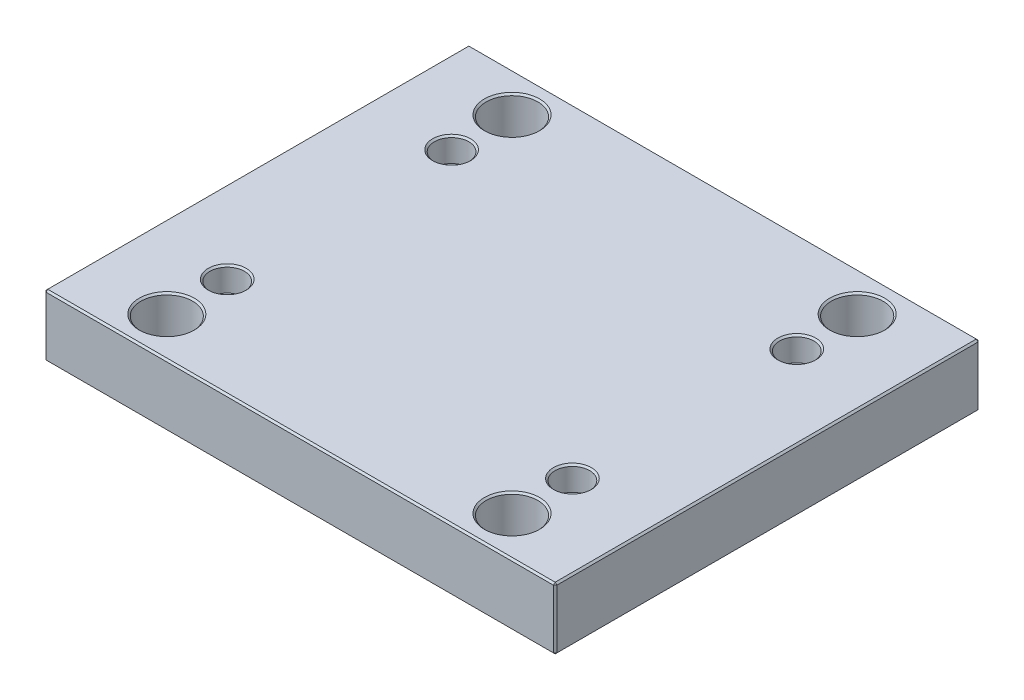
ISO-10303-21;
HEADER;
FILE_DESCRIPTION(('STEP AP214'),'2;1');
FILE_NAME('part.step','',(''),(''),'','','');
FILE_SCHEMA(('AUTOMOTIVE_DESIGN { 1 0 10303 214 1 1 1 1 }'));
ENDSEC;
DATA;
#1=APPLICATION_CONTEXT('core data for automotive mechanical design processes');
#2=APPLICATION_PROTOCOL_DEFINITION('international standard','automotive_design',2000,#1);
#3=PRODUCT_CONTEXT('',#1,'mechanical');
#4=PRODUCT('Part','Part','',(#3));
#5=PRODUCT_RELATED_PRODUCT_CATEGORY('part','',(#4));
#6=PRODUCT_DEFINITION_FORMATION('','',#4);
#7=PRODUCT_DEFINITION_CONTEXT('part definition',#1,'design');
#8=PRODUCT_DEFINITION('design','',#6,#7);
#9=PRODUCT_DEFINITION_SHAPE('','',#8);
#10=(LENGTH_UNIT() NAMED_UNIT(*) SI_UNIT(.MILLI.,.METRE.));
#11=(NAMED_UNIT(*) PLANE_ANGLE_UNIT() SI_UNIT($,.RADIAN.));
#12=(NAMED_UNIT(*) SI_UNIT($,.STERADIAN.) SOLID_ANGLE_UNIT());
#13=UNCERTAINTY_MEASURE_WITH_UNIT(LENGTH_MEASURE(1.E-05),#10,'distance_accuracy_value','');
#14=(GEOMETRIC_REPRESENTATION_CONTEXT(3) GLOBAL_UNCERTAINTY_ASSIGNED_CONTEXT((#13)) GLOBAL_UNIT_ASSIGNED_CONTEXT((#10,
#11,#12)) REPRESENTATION_CONTEXT('',''));
#15=CARTESIAN_POINT('',(0.,0.,0.));
#16=DIRECTION('',(0.,0.,1.));
#17=DIRECTION('',(1.,0.,0.));
#18=AXIS2_PLACEMENT_3D('',#15,#16,#17);
#19=CARTESIAN_POINT('',(-148.,36.,123.));
#20=DIRECTION('',(1.,0.,0.));
#21=DIRECTION('',(0.,0.,-1.));
#22=AXIS2_PLACEMENT_3D('',#19,#20,#21);
#23=PLANE('',#22);
#24=DIRECTION('',(0.,-1.,0.));
#25=VECTOR('',#24,1.);
#26=CARTESIAN_POINT('',(-148.,36.,-122.));
#27=LINE('',#26,#25);
#28=CARTESIAN_POINT('',(-148.,35.,-122.));
#29=VERTEX_POINT('',#28);
#30=CARTESIAN_POINT('',(-148.,1.,-122.));
#31=VERTEX_POINT('',#30);
#32=EDGE_CURVE('E115',#29,#31,#27,.T.);
#33=ORIENTED_EDGE('',*,*,#32,.T.);
#34=DIRECTION('',(0.,0.,1.));
#35=VECTOR('',#34,1.);
#36=CARTESIAN_POINT('',(-148.,1.,123.));
#37=LINE('',#36,#35);
#38=CARTESIAN_POINT('',(-148.,1.,122.));
#39=VERTEX_POINT('',#38);
#40=EDGE_CURVE('E111',#31,#39,#37,.T.);
#41=ORIENTED_EDGE('',*,*,#40,.T.);
#42=DIRECTION('',(0.,1.,0.));
#43=VECTOR('',#42,1.);
#44=CARTESIAN_POINT('',(-148.,36.,122.));
#45=LINE('',#44,#43);
#46=CARTESIAN_POINT('',(-148.,35.,122.));
#47=VERTEX_POINT('',#46);
#48=EDGE_CURVE('E104',#39,#47,#45,.T.);
#49=ORIENTED_EDGE('',*,*,#48,.T.);
#50=DIRECTION('',(0.,0.,-1.));
#51=VECTOR('',#50,1.);
#52=CARTESIAN_POINT('',(-148.,35.,-123.));
#53=LINE('',#52,#51);
#54=EDGE_CURVE('E108',#47,#29,#53,.T.);
#55=ORIENTED_EDGE('',*,*,#54,.T.);
#56=EDGE_LOOP('',(#33,#41,#49,#55));
#57=FACE_BOUND('',#56,.T.);
#58=ADVANCED_FACE('F16',(#57),#23,.F.);
#59=CARTESIAN_POINT('',(148.,36.,123.));
#60=DIRECTION('',(0.,0.,-1.));
#61=DIRECTION('',(-1.,0.,0.));
#62=AXIS2_PLACEMENT_3D('',#59,#60,#61);
#63=PLANE('',#62);
#64=DIRECTION('',(-1.,0.,0.));
#65=VECTOR('',#64,1.);
#66=CARTESIAN_POINT('',(-148.,35.,123.));
#67=LINE('',#66,#65);
#68=CARTESIAN_POINT('',(147.,35.,123.));
#69=VERTEX_POINT('',#68);
#70=CARTESIAN_POINT('',(-147.,35.,123.));
#71=VERTEX_POINT('',#70);
#72=EDGE_CURVE('E170',#69,#71,#67,.T.);
#73=ORIENTED_EDGE('',*,*,#72,.T.);
#74=DIRECTION('',(0.,-1.,0.));
#75=VECTOR('',#74,1.);
#76=CARTESIAN_POINT('',(-147.,36.,123.));
#77=LINE('',#76,#75);
#78=CARTESIAN_POINT('',(-147.,1.,123.));
#79=VERTEX_POINT('',#78);
#80=EDGE_CURVE('E123',#71,#79,#77,.T.);
#81=ORIENTED_EDGE('',*,*,#80,.T.);
#82=DIRECTION('',(1.,0.,0.));
#83=VECTOR('',#82,1.);
#84=CARTESIAN_POINT('',(148.,1.,123.));
#85=LINE('',#84,#83);
#86=CARTESIAN_POINT('',(147.,1.,123.));
#87=VERTEX_POINT('',#86);
#88=EDGE_CURVE('E174',#79,#87,#85,.T.);
#89=ORIENTED_EDGE('',*,*,#88,.T.);
#90=DIRECTION('',(0.,1.,0.));
#91=VECTOR('',#90,1.);
#92=CARTESIAN_POINT('',(147.,36.,123.));
#93=LINE('',#92,#91);
#94=EDGE_CURVE('E172',#87,#69,#93,.T.);
#95=ORIENTED_EDGE('',*,*,#94,.T.);
#96=EDGE_LOOP('',(#73,#81,#89,#95));
#97=FACE_BOUND('',#96,.T.);
#98=ADVANCED_FACE('F413',(#97),#63,.F.);
#99=CARTESIAN_POINT('',(148.,36.,123.));
#100=DIRECTION('',(-1.,0.,0.));
#101=DIRECTION('',(0.,0.,1.));
#102=AXIS2_PLACEMENT_3D('',#99,#100,#101);
#103=PLANE('',#102);
#104=DIRECTION('',(0.,0.,-1.));
#105=VECTOR('',#104,1.);
#106=CARTESIAN_POINT('',(148.,1.,123.));
#107=LINE('',#106,#105);
#108=CARTESIAN_POINT('',(148.,1.,122.));
#109=VERTEX_POINT('',#108);
#110=CARTESIAN_POINT('',(148.,1.,-122.));
#111=VERTEX_POINT('',#110);
#112=EDGE_CURVE('E165',#109,#111,#107,.T.);
#113=ORIENTED_EDGE('',*,*,#112,.T.);
#114=DIRECTION('',(0.,1.,0.));
#115=VECTOR('',#114,1.);
#116=CARTESIAN_POINT('',(148.,36.,-122.));
#117=LINE('',#116,#115);
#118=CARTESIAN_POINT('',(148.,35.,-122.));
#119=VERTEX_POINT('',#118);
#120=EDGE_CURVE('E167',#111,#119,#117,.T.);
#121=ORIENTED_EDGE('',*,*,#120,.T.);
#122=DIRECTION('',(0.,0.,1.));
#123=VECTOR('',#122,1.);
#124=CARTESIAN_POINT('',(148.,35.,123.));
#125=LINE('',#124,#123);
#126=CARTESIAN_POINT('',(148.,35.,122.));
#127=VERTEX_POINT('',#126);
#128=EDGE_CURVE('E161',#119,#127,#125,.T.);
#129=ORIENTED_EDGE('',*,*,#128,.T.);
#130=DIRECTION('',(0.,-1.,0.));
#131=VECTOR('',#130,1.);
#132=CARTESIAN_POINT('',(148.,36.,122.));
#133=LINE('',#132,#131);
#134=EDGE_CURVE('E163',#127,#109,#133,.T.);
#135=ORIENTED_EDGE('',*,*,#134,.T.);
#136=EDGE_LOOP('',(#113,#121,#129,#135));
#137=FACE_BOUND('',#136,.T.);
#138=ADVANCED_FACE('F406',(#137),#103,.F.);
#139=CARTESIAN_POINT('',(148.,36.,-123.));
#140=DIRECTION('',(0.,0.,1.));
#141=DIRECTION('',(1.,0.,0.));
#142=AXIS2_PLACEMENT_3D('',#139,#140,#141);
#143=PLANE('',#142);
#144=DIRECTION('',(0.,-1.,0.));
#145=VECTOR('',#144,1.);
#146=CARTESIAN_POINT('',(147.,36.,-123.));
#147=LINE('',#146,#145);
#148=CARTESIAN_POINT('',(147.,35.,-123.));
#149=VERTEX_POINT('',#148);
#150=CARTESIAN_POINT('',(147.,1.,-123.));
#151=VERTEX_POINT('',#150);
#152=EDGE_CURVE('E154',#149,#151,#147,.T.);
#153=ORIENTED_EDGE('',*,*,#152,.T.);
#154=DIRECTION('',(-1.,0.,0.));
#155=VECTOR('',#154,1.);
#156=CARTESIAN_POINT('',(148.,1.,-123.));
#157=LINE('',#156,#155);
#158=CARTESIAN_POINT('',(-147.,1.,-123.));
#159=VERTEX_POINT('',#158);
#160=EDGE_CURVE('E159',#151,#159,#157,.T.);
#161=ORIENTED_EDGE('',*,*,#160,.T.);
#162=DIRECTION('',(0.,1.,0.));
#163=VECTOR('',#162,1.);
#164=CARTESIAN_POINT('',(-147.,36.,-123.));
#165=LINE('',#164,#163);
#166=CARTESIAN_POINT('',(-147.,35.,-123.));
#167=VERTEX_POINT('',#166);
#168=EDGE_CURVE('E156',#159,#167,#165,.T.);
#169=ORIENTED_EDGE('',*,*,#168,.T.);
#170=DIRECTION('',(1.,0.,0.));
#171=VECTOR('',#170,1.);
#172=CARTESIAN_POINT('',(148.,35.,-123.));
#173=LINE('',#172,#171);
#174=EDGE_CURVE('E152',#167,#149,#173,.T.);
#175=ORIENTED_EDGE('',*,*,#174,.T.);
#176=EDGE_LOOP('',(#153,#161,#169,#175));
#177=FACE_BOUND('',#176,.T.);
#178=ADVANCED_FACE('F431',(#177),#143,.F.);
#179=CARTESIAN_POINT('',(0.,36.,0.));
#180=DIRECTION('',(0.,1.,0.));
#181=DIRECTION('',(0.,0.,1.));
#182=AXIS2_PLACEMENT_3D('',#179,#180,#181);
#183=PLANE('',#182);
#184=CARTESIAN_POINT('',(-100.,36.,100.));
#185=DIRECTION('',(0.,1.,0.));
#186=DIRECTION('',(0.,0.,1.));
#187=AXIS2_PLACEMENT_3D('',#184,#185,#186);
#188=CIRCLE('',#187,16.);
#189=CARTESIAN_POINT('',(-100.,36.,116.));
#190=VERTEX_POINT('',#189);
#191=EDGE_CURVE('E317',#190,#190,#188,.F.);
#192=ORIENTED_EDGE('',*,*,#191,.T.);
#193=EDGE_LOOP('',(#192));
#194=FACE_BOUND('',#193,.T.);
#195=CARTESIAN_POINT('',(100.,36.,100.));
#196=DIRECTION('',(0.,1.,0.));
#197=DIRECTION('',(0.,0.,1.));
#198=AXIS2_PLACEMENT_3D('',#195,#196,#197);
#199=CIRCLE('',#198,16.);
#200=CARTESIAN_POINT('',(100.,36.,116.));
#201=VERTEX_POINT('',#200);
#202=EDGE_CURVE('E314',#201,#201,#199,.F.);
#203=ORIENTED_EDGE('',*,*,#202,.T.);
#204=EDGE_LOOP('',(#203));
#205=FACE_BOUND('',#204,.T.);
#206=CARTESIAN_POINT('',(100.,36.,-100.));
#207=DIRECTION('',(0.,1.,0.));
#208=DIRECTION('',(0.,0.,1.));
#209=AXIS2_PLACEMENT_3D('',#206,#207,#208);
#210=CIRCLE('',#209,16.);
#211=CARTESIAN_POINT('',(100.,36.,-84.));
#212=VERTEX_POINT('',#211);
#213=EDGE_CURVE('E311',#212,#212,#210,.F.);
#214=ORIENTED_EDGE('',*,*,#213,.T.);
#215=EDGE_LOOP('',(#214));
#216=FACE_BOUND('',#215,.T.);
#217=CARTESIAN_POINT('',(-100.,36.,-100.));
#218=DIRECTION('',(0.,1.,0.));
#219=DIRECTION('',(0.,0.,1.));
#220=AXIS2_PLACEMENT_3D('',#217,#218,#219);
#221=CIRCLE('',#220,16.);
#222=CARTESIAN_POINT('',(-100.,36.,-84.));
#223=VERTEX_POINT('',#222);
#224=EDGE_CURVE('E308',#223,#223,#221,.F.);
#225=ORIENTED_EDGE('',*,*,#224,.T.);
#226=EDGE_LOOP('',(#225));
#227=FACE_BOUND('',#226,.T.);
#228=CARTESIAN_POINT('',(-100.,36.,65.));
#229=DIRECTION('',(0.,1.,0.));
#230=DIRECTION('',(0.,0.,1.));
#231=AXIS2_PLACEMENT_3D('',#228,#229,#230);
#232=CIRCLE('',#231,11.);
#233=CARTESIAN_POINT('',(-100.,36.,76.));
#234=VERTEX_POINT('',#233);
#235=EDGE_CURVE('E290',#234,#234,#232,.F.);
#236=ORIENTED_EDGE('',*,*,#235,.T.);
#237=EDGE_LOOP('',(#236));
#238=FACE_BOUND('',#237,.T.);
#239=CARTESIAN_POINT('',(100.,36.,65.));
#240=DIRECTION('',(0.,1.,0.));
#241=DIRECTION('',(0.,0.,1.));
#242=AXIS2_PLACEMENT_3D('',#239,#240,#241);
#243=CIRCLE('',#242,11.);
#244=CARTESIAN_POINT('',(100.,36.,76.));
#245=VERTEX_POINT('',#244);
#246=EDGE_CURVE('E287',#245,#245,#243,.F.);
#247=ORIENTED_EDGE('',*,*,#246,.T.);
#248=EDGE_LOOP('',(#247));
#249=FACE_BOUND('',#248,.T.);
#250=CARTESIAN_POINT('',(100.,36.,-65.));
#251=DIRECTION('',(0.,1.,0.));
#252=DIRECTION('',(0.,0.,1.));
#253=AXIS2_PLACEMENT_3D('',#250,#251,#252);
#254=CIRCLE('',#253,11.);
#255=CARTESIAN_POINT('',(100.,36.,-54.));
#256=VERTEX_POINT('',#255);
#257=EDGE_CURVE('E284',#256,#256,#254,.F.);
#258=ORIENTED_EDGE('',*,*,#257,.T.);
#259=EDGE_LOOP('',(#258));
#260=FACE_BOUND('',#259,.T.);
#261=CARTESIAN_POINT('',(-100.,36.,-65.));
#262=DIRECTION('',(0.,1.,0.));
#263=DIRECTION('',(0.,0.,1.));
#264=AXIS2_PLACEMENT_3D('',#261,#262,#263);
#265=CIRCLE('',#264,11.);
#266=CARTESIAN_POINT('',(-100.,36.,-54.));
#267=VERTEX_POINT('',#266);
#268=EDGE_CURVE('E281',#267,#267,#265,.F.);
#269=ORIENTED_EDGE('',*,*,#268,.T.);
#270=EDGE_LOOP('',(#269));
#271=FACE_BOUND('',#270,.T.);
#272=DIRECTION('',(0.,0.,-1.));
#273=VECTOR('',#272,1.);
#274=CARTESIAN_POINT('',(147.,36.,-123.));
#275=LINE('',#274,#273);
#276=CARTESIAN_POINT('',(147.,36.,122.));
#277=VERTEX_POINT('',#276);
#278=CARTESIAN_POINT('',(147.,36.,-122.));
#279=VERTEX_POINT('',#278);
#280=EDGE_CURVE('E31',#277,#279,#275,.T.);
#281=ORIENTED_EDGE('',*,*,#280,.T.);
#282=DIRECTION('',(-1.,0.,0.));
#283=VECTOR('',#282,1.);
#284=CARTESIAN_POINT('',(-148.,36.,-122.));
#285=LINE('',#284,#283);
#286=CARTESIAN_POINT('',(-147.,36.,-122.));
#287=VERTEX_POINT('',#286);
#288=EDGE_CURVE('E190',#279,#287,#285,.T.);
#289=ORIENTED_EDGE('',*,*,#288,.T.);
#290=DIRECTION('',(0.,0.,1.));
#291=VECTOR('',#290,1.);
#292=CARTESIAN_POINT('',(-147.,36.,123.));
#293=LINE('',#292,#291);
#294=CARTESIAN_POINT('',(-147.,36.,122.));
#295=VERTEX_POINT('',#294);
#296=EDGE_CURVE('E186',#287,#295,#293,.T.);
#297=ORIENTED_EDGE('',*,*,#296,.T.);
#298=DIRECTION('',(1.,0.,0.));
#299=VECTOR('',#298,1.);
#300=CARTESIAN_POINT('',(148.,36.,122.));
#301=LINE('',#300,#299);
#302=EDGE_CURVE('E36',#295,#277,#301,.T.);
#303=ORIENTED_EDGE('',*,*,#302,.T.);
#304=EDGE_LOOP('',(#281,#289,#297,#303));
#305=FACE_BOUND('',#304,.T.);
#306=ADVANCED_FACE('F357',(#194,#205,#216,#227,#238,#249,#260,#271,#305),#183,.T.);
#307=CARTESIAN_POINT('',(0.,0.,0.));
#308=DIRECTION('',(0.,1.,0.));
#309=DIRECTION('',(0.,0.,1.));
#310=AXIS2_PLACEMENT_3D('',#307,#308,#309);
#311=PLANE('',#310);
#312=CARTESIAN_POINT('',(-100.,0.,100.));
#313=DIRECTION('',(0.,1.,0.));
#314=DIRECTION('',(0.,0.,1.));
#315=AXIS2_PLACEMENT_3D('',#312,#313,#314);
#316=CIRCLE('',#315,16.);
#317=CARTESIAN_POINT('',(-100.,0.,116.));
#318=VERTEX_POINT('',#317);
#319=EDGE_CURVE('E329',#318,#318,#316,.T.);
#320=ORIENTED_EDGE('',*,*,#319,.T.);
#321=EDGE_LOOP('',(#320));
#322=FACE_BOUND('',#321,.T.);
#323=CARTESIAN_POINT('',(100.,0.,100.));
#324=DIRECTION('',(0.,1.,0.));
#325=DIRECTION('',(0.,0.,1.));
#326=AXIS2_PLACEMENT_3D('',#323,#324,#325);
#327=CIRCLE('',#326,16.);
#328=CARTESIAN_POINT('',(100.,0.,116.));
#329=VERTEX_POINT('',#328);
#330=EDGE_CURVE('E326',#329,#329,#327,.T.);
#331=ORIENTED_EDGE('',*,*,#330,.T.);
#332=EDGE_LOOP('',(#331));
#333=FACE_BOUND('',#332,.T.);
#334=CARTESIAN_POINT('',(100.,0.,-100.));
#335=DIRECTION('',(0.,1.,0.));
#336=DIRECTION('',(0.,0.,1.));
#337=AXIS2_PLACEMENT_3D('',#334,#335,#336);
#338=CIRCLE('',#337,16.);
#339=CARTESIAN_POINT('',(100.,0.,-84.));
#340=VERTEX_POINT('',#339);
#341=EDGE_CURVE('E323',#340,#340,#338,.T.);
#342=ORIENTED_EDGE('',*,*,#341,.T.);
#343=EDGE_LOOP('',(#342));
#344=FACE_BOUND('',#343,.T.);
#345=CARTESIAN_POINT('',(-100.,0.,-100.));
#346=DIRECTION('',(0.,1.,0.));
#347=DIRECTION('',(0.,0.,1.));
#348=AXIS2_PLACEMENT_3D('',#345,#346,#347);
#349=CIRCLE('',#348,16.);
#350=CARTESIAN_POINT('',(-100.,0.,-84.));
#351=VERTEX_POINT('',#350);
#352=EDGE_CURVE('E320',#351,#351,#349,.T.);
#353=ORIENTED_EDGE('',*,*,#352,.T.);
#354=EDGE_LOOP('',(#353));
#355=FACE_BOUND('',#354,.T.);
#356=CARTESIAN_POINT('',(100.,0.,-65.));
#357=DIRECTION('',(0.,1.,0.));
#358=DIRECTION('',(0.,0.,1.));
#359=AXIS2_PLACEMENT_3D('',#356,#357,#358);
#360=CIRCLE('',#359,8.);
#361=CARTESIAN_POINT('',(100.,0.,-57.));
#362=VERTEX_POINT('',#361);
#363=EDGE_CURVE('E263',#362,#362,#360,.T.);
#364=ORIENTED_EDGE('',*,*,#363,.T.);
#365=EDGE_LOOP('',(#364));
#366=FACE_BOUND('',#365,.T.);
#367=CARTESIAN_POINT('',(100.,0.,65.));
#368=DIRECTION('',(0.,1.,0.));
#369=DIRECTION('',(0.,0.,1.));
#370=AXIS2_PLACEMENT_3D('',#367,#368,#369);
#371=CIRCLE('',#370,8.);
#372=CARTESIAN_POINT('',(100.,0.,73.));
#373=VERTEX_POINT('',#372);
#374=EDGE_CURVE('E260',#373,#373,#371,.T.);
#375=ORIENTED_EDGE('',*,*,#374,.T.);
#376=EDGE_LOOP('',(#375));
#377=FACE_BOUND('',#376,.T.);
#378=CARTESIAN_POINT('',(-100.,0.,65.));
#379=DIRECTION('',(0.,1.,0.));
#380=DIRECTION('',(0.,0.,1.));
#381=AXIS2_PLACEMENT_3D('',#378,#379,#380);
#382=CIRCLE('',#381,8.);
#383=CARTESIAN_POINT('',(-100.,0.,73.));
#384=VERTEX_POINT('',#383);
#385=EDGE_CURVE('E257',#384,#384,#382,.T.);
#386=ORIENTED_EDGE('',*,*,#385,.T.);
#387=EDGE_LOOP('',(#386));
#388=FACE_BOUND('',#387,.T.);
#389=CARTESIAN_POINT('',(-100.,0.,-65.));
#390=DIRECTION('',(0.,1.,0.));
#391=DIRECTION('',(0.,0.,1.));
#392=AXIS2_PLACEMENT_3D('',#389,#390,#391);
#393=CIRCLE('',#392,8.);
#394=CARTESIAN_POINT('',(-100.,0.,-57.));
#395=VERTEX_POINT('',#394);
#396=EDGE_CURVE('E192',#395,#395,#393,.T.);
#397=ORIENTED_EDGE('',*,*,#396,.T.);
#398=EDGE_LOOP('',(#397));
#399=FACE_BOUND('',#398,.T.);
#400=DIRECTION('',(0.,0.,1.));
#401=VECTOR('',#400,1.);
#402=CARTESIAN_POINT('',(147.,0.,0.));
#403=LINE('',#402,#401);
#404=CARTESIAN_POINT('',(147.,0.,-122.));
#405=VERTEX_POINT('',#404);
#406=CARTESIAN_POINT('',(147.,0.,122.));
#407=VERTEX_POINT('',#406);
#408=EDGE_CURVE('E177',#405,#407,#403,.T.);
#409=ORIENTED_EDGE('',*,*,#408,.T.);
#410=DIRECTION('',(-1.,0.,0.));
#411=VECTOR('',#410,1.);
#412=CARTESIAN_POINT('',(0.,0.,122.));
#413=LINE('',#412,#411);
#414=CARTESIAN_POINT('',(-147.,0.,122.));
#415=VERTEX_POINT('',#414);
#416=EDGE_CURVE('E183',#407,#415,#413,.T.);
#417=ORIENTED_EDGE('',*,*,#416,.T.);
#418=DIRECTION('',(0.,0.,-1.));
#419=VECTOR('',#418,1.);
#420=CARTESIAN_POINT('',(-147.,0.,0.));
#421=LINE('',#420,#419);
#422=CARTESIAN_POINT('',(-147.,0.,-122.));
#423=VERTEX_POINT('',#422);
#424=EDGE_CURVE('E181',#415,#423,#421,.T.);
#425=ORIENTED_EDGE('',*,*,#424,.T.);
#426=DIRECTION('',(1.,0.,0.));
#427=VECTOR('',#426,1.);
#428=CARTESIAN_POINT('',(0.,0.,-122.));
#429=LINE('',#428,#427);
#430=EDGE_CURVE('E179',#423,#405,#429,.T.);
#431=ORIENTED_EDGE('',*,*,#430,.T.);
#432=EDGE_LOOP('',(#409,#417,#425,#431));
#433=FACE_BOUND('',#432,.T.);
#434=ADVANCED_FACE('F353',(#322,#333,#344,#355,#366,#377,#388,#399,#433),#311,.F.);
#435=CARTESIAN_POINT('',(148.,36.,122.));
#436=DIRECTION('',(-0.707106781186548,0.,-0.707106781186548));
#437=DIRECTION('',(0.,-1.,0.));
#438=AXIS2_PLACEMENT_3D('',#435,#436,#437);
#439=PLANE('',#438);
#440=DIRECTION('',(-0.707106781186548,0.,0.707106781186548));
#441=VECTOR('',#440,1.);
#442=CARTESIAN_POINT('',(147.,35.,123.));
#443=LINE('',#442,#441);
#444=EDGE_CURVE('E141',#69,#127,#443,.F.);
#445=ORIENTED_EDGE('',*,*,#444,.F.);
#446=ORIENTED_EDGE('',*,*,#94,.F.);
#447=DIRECTION('',(0.707106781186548,0.,-0.707106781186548));
#448=VECTOR('',#447,1.);
#449=CARTESIAN_POINT('',(147.,1.,123.));
#450=LINE('',#449,#448);
#451=EDGE_CURVE('E144',#109,#87,#450,.F.);
#452=ORIENTED_EDGE('',*,*,#451,.F.);
#453=ORIENTED_EDGE('',*,*,#134,.F.);
#454=EDGE_LOOP('',(#445,#446,#452,#453));
#455=FACE_BOUND('',#454,.T.);
#456=ADVANCED_FACE('F356',(#455),#439,.F.);
#457=CARTESIAN_POINT('',(147.,35.,123.));
#458=DIRECTION('',(0.577350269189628,0.57735026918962,0.577350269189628));
#459=DIRECTION('',(0.707106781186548,0.,-0.707106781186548));
#460=AXIS2_PLACEMENT_3D('',#457,#458,#459);
#461=PLANE('',#460);
#462=DIRECTION('',(0.,-0.70710678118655,0.707106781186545));
#463=VECTOR('',#462,1.);
#464=CARTESIAN_POINT('',(147.,35.,123.));
#465=LINE('',#464,#463);
#466=EDGE_CURVE('E235',#69,#277,#465,.F.);
#467=ORIENTED_EDGE('',*,*,#466,.F.);
#468=ORIENTED_EDGE('',*,*,#444,.T.);
#469=DIRECTION('',(-0.707106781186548,0.707106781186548,0.));
#470=VECTOR('',#469,1.);
#471=CARTESIAN_POINT('',(147.5,35.5,122.));
#472=LINE('',#471,#470);
#473=EDGE_CURVE('E237',#277,#127,#472,.F.);
#474=ORIENTED_EDGE('',*,*,#473,.F.);
#475=EDGE_LOOP('',(#467,#468,#474));
#476=FACE_BOUND('',#475,.T.);
#477=ADVANCED_FACE('F419',(#476),#461,.T.);
#478=CARTESIAN_POINT('',(147.,1.,123.));
#479=DIRECTION('',(0.577350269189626,-0.577350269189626,0.577350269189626));
#480=DIRECTION('',(0.707106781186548,0.,-0.707106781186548));
#481=AXIS2_PLACEMENT_3D('',#478,#479,#480);
#482=PLANE('',#481);
#483=DIRECTION('',(-0.707106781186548,-0.707106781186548,0.));
#484=VECTOR('',#483,1.);
#485=CARTESIAN_POINT('',(147.5,0.5,122.));
#486=LINE('',#485,#484);
#487=EDGE_CURVE('E229',#109,#407,#486,.T.);
#488=ORIENTED_EDGE('',*,*,#487,.F.);
#489=ORIENTED_EDGE('',*,*,#451,.T.);
#490=DIRECTION('',(0.,0.70710678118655,0.707106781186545));
#491=VECTOR('',#490,1.);
#492=CARTESIAN_POINT('',(147.,1.,123.));
#493=LINE('',#492,#491);
#494=EDGE_CURVE('E232',#407,#87,#493,.T.);
#495=ORIENTED_EDGE('',*,*,#494,.F.);
#496=EDGE_LOOP('',(#488,#489,#495));
#497=FACE_BOUND('',#496,.T.);
#498=ADVANCED_FACE('F378',(#497),#482,.T.);
#499=CARTESIAN_POINT('',(147.,36.,0.));
#500=DIRECTION('',(0.707106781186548,0.707106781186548,0.));
#501=DIRECTION('',(0.,0.,1.));
#502=AXIS2_PLACEMENT_3D('',#499,#500,#501);
#503=PLANE('',#502);
#504=ORIENTED_EDGE('',*,*,#473,.T.);
#505=ORIENTED_EDGE('',*,*,#128,.F.);
#506=DIRECTION('',(0.707106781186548,-0.707106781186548,0.));
#507=VECTOR('',#506,1.);
#508=CARTESIAN_POINT('',(148.,35.,-122.));
#509=LINE('',#508,#507);
#510=EDGE_CURVE('E224',#279,#119,#509,.T.);
#511=ORIENTED_EDGE('',*,*,#510,.F.);
#512=ORIENTED_EDGE('',*,*,#280,.F.);
#513=EDGE_LOOP('',(#504,#505,#511,#512));
#514=FACE_BOUND('',#513,.T.);
#515=ADVANCED_FACE('F421',(#514),#503,.T.);
#516=CARTESIAN_POINT('',(0.,36.,122.));
#517=DIRECTION('',(0.,0.707106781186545,0.70710678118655));
#518=DIRECTION('',(-1.,0.,0.));
#519=AXIS2_PLACEMENT_3D('',#516,#517,#518);
#520=PLANE('',#519);
#521=ORIENTED_EDGE('',*,*,#466,.T.);
#522=ORIENTED_EDGE('',*,*,#302,.F.);
#523=DIRECTION('',(0.,0.70710678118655,-0.707106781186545));
#524=VECTOR('',#523,1.);
#525=CARTESIAN_POINT('',(-147.,35.5,122.5));
#526=LINE('',#525,#524);
#527=EDGE_CURVE('E127',#71,#295,#526,.T.);
#528=ORIENTED_EDGE('',*,*,#527,.F.);
#529=ORIENTED_EDGE('',*,*,#72,.F.);
#530=EDGE_LOOP('',(#521,#522,#528,#529));
#531=FACE_BOUND('',#530,.T.);
#532=ADVANCED_FACE('F416',(#531),#520,.T.);
#533=CARTESIAN_POINT('',(-147.,36.,123.));
#534=DIRECTION('',(0.707106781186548,0.,-0.707106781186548));
#535=DIRECTION('',(0.,-1.,0.));
#536=AXIS2_PLACEMENT_3D('',#533,#534,#535);
#537=PLANE('',#536);
#538=DIRECTION('',(0.707106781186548,0.,0.707106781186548));
#539=VECTOR('',#538,1.);
#540=CARTESIAN_POINT('',(-147.,1.,123.));
#541=LINE('',#540,#539);
#542=EDGE_CURVE('E128',#79,#39,#541,.F.);
#543=ORIENTED_EDGE('',*,*,#542,.F.);
#544=ORIENTED_EDGE('',*,*,#80,.F.);
#545=DIRECTION('',(-0.707106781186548,0.,-0.707106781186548));
#546=VECTOR('',#545,1.);
#547=CARTESIAN_POINT('',(-148.,35.,122.));
#548=LINE('',#547,#546);
#549=EDGE_CURVE('E119',#47,#71,#548,.F.);
#550=ORIENTED_EDGE('',*,*,#549,.F.);
#551=ORIENTED_EDGE('',*,*,#48,.F.);
#552=EDGE_LOOP('',(#543,#544,#550,#551));
#553=FACE_BOUND('',#552,.T.);
#554=ADVANCED_FACE('F121',(#553),#537,.F.);
#555=CARTESIAN_POINT('',(148.,1.,123.));
#556=DIRECTION('',(0.,0.707106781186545,-0.70710678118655));
#557=DIRECTION('',(1.,0.,0.));
#558=AXIS2_PLACEMENT_3D('',#555,#556,#557);
#559=PLANE('',#558);
#560=ORIENTED_EDGE('',*,*,#494,.T.);
#561=ORIENTED_EDGE('',*,*,#88,.F.);
#562=DIRECTION('',(0.,-0.70710678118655,-0.707106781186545));
#563=VECTOR('',#562,1.);
#564=CARTESIAN_POINT('',(-147.,1.,123.));
#565=LINE('',#564,#563);
#566=EDGE_CURVE('E220',#415,#79,#565,.F.);
#567=ORIENTED_EDGE('',*,*,#566,.F.);
#568=ORIENTED_EDGE('',*,*,#416,.F.);
#569=EDGE_LOOP('',(#560,#561,#567,#568));
#570=FACE_BOUND('',#569,.T.);
#571=ADVANCED_FACE('F383',(#570),#559,.F.);
#572=CARTESIAN_POINT('',(148.,1.,123.));
#573=DIRECTION('',(-0.707106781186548,0.707106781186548,0.));
#574=DIRECTION('',(0.,0.,-1.));
#575=AXIS2_PLACEMENT_3D('',#572,#573,#574);
#576=PLANE('',#575);
#577=ORIENTED_EDGE('',*,*,#487,.T.);
#578=ORIENTED_EDGE('',*,*,#408,.F.);
#579=DIRECTION('',(0.707106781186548,0.707106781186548,0.));
#580=VECTOR('',#579,1.);
#581=CARTESIAN_POINT('',(147.5,0.500000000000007,-122.));
#582=LINE('',#581,#580);
#583=EDGE_CURVE('E217',#111,#405,#582,.F.);
#584=ORIENTED_EDGE('',*,*,#583,.F.);
#585=ORIENTED_EDGE('',*,*,#112,.F.);
#586=EDGE_LOOP('',(#577,#578,#584,#585));
#587=FACE_BOUND('',#586,.T.);
#588=ADVANCED_FACE('F376',(#587),#576,.F.);
#589=CARTESIAN_POINT('',(147.,36.,-123.));
#590=DIRECTION('',(-0.707106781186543,0.,0.707106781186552));
#591=DIRECTION('',(0.,-1.,0.));
#592=AXIS2_PLACEMENT_3D('',#589,#590,#591);
#593=PLANE('',#592);
#594=DIRECTION('',(0.707106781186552,0.,0.707106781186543));
#595=VECTOR('',#594,1.);
#596=CARTESIAN_POINT('',(148.,35.,-122.));
#597=LINE('',#596,#595);
#598=EDGE_CURVE('E226',#119,#149,#597,.F.);
#599=ORIENTED_EDGE('',*,*,#598,.F.);
#600=ORIENTED_EDGE('',*,*,#120,.F.);
#601=DIRECTION('',(-0.707106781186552,0.,-0.707106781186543));
#602=VECTOR('',#601,1.);
#603=CARTESIAN_POINT('',(147.,1.,-123.));
#604=LINE('',#603,#602);
#605=EDGE_CURVE('E214',#151,#111,#604,.F.);
#606=ORIENTED_EDGE('',*,*,#605,.F.);
#607=ORIENTED_EDGE('',*,*,#152,.F.);
#608=EDGE_LOOP('',(#599,#600,#606,#607));
#609=FACE_BOUND('',#608,.T.);
#610=ADVANCED_FACE('F403',(#609),#593,.F.);
#611=CARTESIAN_POINT('',(148.,35.,-122.));
#612=DIRECTION('',(0.57735026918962,0.577350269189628,-0.577350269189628));
#613=DIRECTION('',(0.,0.707106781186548,0.707106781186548));
#614=AXIS2_PLACEMENT_3D('',#611,#612,#613);
#615=PLANE('',#614);
#616=ORIENTED_EDGE('',*,*,#510,.T.);
#617=ORIENTED_EDGE('',*,*,#598,.T.);
#618=DIRECTION('',(0.,0.707106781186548,0.707106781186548));
#619=VECTOR('',#618,1.);
#620=CARTESIAN_POINT('',(147.,35.5,-122.5));
#621=LINE('',#620,#619);
#622=EDGE_CURVE('E135',#279,#149,#621,.F.);
#623=ORIENTED_EDGE('',*,*,#622,.F.);
#624=EDGE_LOOP('',(#616,#617,#623));
#625=FACE_BOUND('',#624,.T.);
#626=ADVANCED_FACE('F425',(#625),#615,.T.);
#627=CARTESIAN_POINT('',(-148.,35.,122.));
#628=DIRECTION('',(-0.577350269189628,0.57735026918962,0.577350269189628));
#629=DIRECTION('',(0.707106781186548,0.,0.707106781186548));
#630=AXIS2_PLACEMENT_3D('',#627,#628,#629);
#631=PLANE('',#630);
#632=ORIENTED_EDGE('',*,*,#549,.T.);
#633=ORIENTED_EDGE('',*,*,#527,.T.);
#634=DIRECTION('',(-0.707106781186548,-0.707106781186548,0.));
#635=VECTOR('',#634,1.);
#636=CARTESIAN_POINT('',(-148.,35.,122.));
#637=LINE('',#636,#635);
#638=EDGE_CURVE('E131',#47,#295,#637,.F.);
#639=ORIENTED_EDGE('',*,*,#638,.F.);
#640=EDGE_LOOP('',(#632,#633,#639));
#641=FACE_BOUND('',#640,.T.);
#642=ADVANCED_FACE('F132',(#641),#631,.T.);
#643=CARTESIAN_POINT('',(-147.,1.,123.));
#644=DIRECTION('',(-0.577350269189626,-0.577350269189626,0.577350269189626));
#645=DIRECTION('',(0.707106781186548,0.,0.707106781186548));
#646=AXIS2_PLACEMENT_3D('',#643,#644,#645);
#647=PLANE('',#646);
#648=ORIENTED_EDGE('',*,*,#566,.T.);
#649=ORIENTED_EDGE('',*,*,#542,.T.);
#650=DIRECTION('',(-0.707106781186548,0.707106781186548,0.));
#651=VECTOR('',#650,1.);
#652=CARTESIAN_POINT('',(-147.5,0.5,122.));
#653=LINE('',#652,#651);
#654=EDGE_CURVE('E136',#415,#39,#653,.T.);
#655=ORIENTED_EDGE('',*,*,#654,.F.);
#656=EDGE_LOOP('',(#648,#649,#655));
#657=FACE_BOUND('',#656,.T.);
#658=ADVANCED_FACE('F386',(#657),#647,.T.);
#659=CARTESIAN_POINT('',(147.,1.,-123.));
#660=DIRECTION('',(0.57735026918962,-0.577350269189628,-0.577350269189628));
#661=DIRECTION('',(0.,0.707106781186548,-0.707106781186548));
#662=AXIS2_PLACEMENT_3D('',#659,#660,#661);
#663=PLANE('',#662);
#664=ORIENTED_EDGE('',*,*,#605,.T.);
#665=ORIENTED_EDGE('',*,*,#583,.T.);
#666=DIRECTION('',(0.,-0.707106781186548,0.707106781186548));
#667=VECTOR('',#666,1.);
#668=CARTESIAN_POINT('',(147.,1.,-123.));
#669=LINE('',#668,#667);
#670=EDGE_CURVE('E207',#151,#405,#669,.T.);
#671=ORIENTED_EDGE('',*,*,#670,.F.);
#672=EDGE_LOOP('',(#664,#665,#671));
#673=FACE_BOUND('',#672,.T.);
#674=ADVANCED_FACE('F397',(#673),#663,.T.);
#675=CARTESIAN_POINT('',(0.,36.,-122.));
#676=DIRECTION('',(0.,0.707106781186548,-0.707106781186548));
#677=DIRECTION('',(1.,0.,0.));
#678=AXIS2_PLACEMENT_3D('',#675,#676,#677);
#679=PLANE('',#678);
#680=ORIENTED_EDGE('',*,*,#622,.T.);
#681=ORIENTED_EDGE('',*,*,#174,.F.);
#682=DIRECTION('',(0.,-0.707106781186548,-0.707106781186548));
#683=VECTOR('',#682,1.);
#684=CARTESIAN_POINT('',(-147.,35.,-123.));
#685=LINE('',#684,#683);
#686=EDGE_CURVE('E204',#287,#167,#685,.T.);
#687=ORIENTED_EDGE('',*,*,#686,.F.);
#688=ORIENTED_EDGE('',*,*,#288,.F.);
#689=EDGE_LOOP('',(#680,#681,#687,#688));
#690=FACE_BOUND('',#689,.T.);
#691=ADVANCED_FACE('F429',(#690),#679,.T.);
#692=CARTESIAN_POINT('',(-147.,36.,0.));
#693=DIRECTION('',(-0.707106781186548,0.707106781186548,0.));
#694=DIRECTION('',(0.,0.,-1.));
#695=AXIS2_PLACEMENT_3D('',#692,#693,#694);
#696=PLANE('',#695);
#697=ORIENTED_EDGE('',*,*,#638,.T.);
#698=ORIENTED_EDGE('',*,*,#296,.F.);
#699=DIRECTION('',(0.707106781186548,0.707106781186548,0.));
#700=VECTOR('',#699,1.);
#701=CARTESIAN_POINT('',(-147.5,35.5,-122.));
#702=LINE('',#701,#700);
#703=EDGE_CURVE('E139',#29,#287,#702,.T.);
#704=ORIENTED_EDGE('',*,*,#703,.F.);
#705=ORIENTED_EDGE('',*,*,#54,.F.);
#706=EDGE_LOOP('',(#697,#698,#704,#705));
#707=FACE_BOUND('',#706,.T.);
#708=ADVANCED_FACE('F138',(#707),#696,.T.);
#709=CARTESIAN_POINT('',(-148.,1.,123.));
#710=DIRECTION('',(0.707106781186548,0.707106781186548,0.));
#711=DIRECTION('',(0.,0.,1.));
#712=AXIS2_PLACEMENT_3D('',#709,#710,#711);
#713=PLANE('',#712);
#714=ORIENTED_EDGE('',*,*,#654,.T.);
#715=ORIENTED_EDGE('',*,*,#40,.F.);
#716=DIRECTION('',(0.707106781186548,-0.707106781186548,0.));
#717=VECTOR('',#716,1.);
#718=CARTESIAN_POINT('',(-148.,1.,-122.));
#719=LINE('',#718,#717);
#720=EDGE_CURVE('E200',#423,#31,#719,.F.);
#721=ORIENTED_EDGE('',*,*,#720,.F.);
#722=ORIENTED_EDGE('',*,*,#424,.F.);
#723=EDGE_LOOP('',(#714,#715,#721,#722));
#724=FACE_BOUND('',#723,.T.);
#725=ADVANCED_FACE('F388',(#724),#713,.F.);
#726=CARTESIAN_POINT('',(148.,1.,-123.));
#727=DIRECTION('',(0.,0.707106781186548,0.707106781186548));
#728=DIRECTION('',(-1.,0.,0.));
#729=AXIS2_PLACEMENT_3D('',#726,#727,#728);
#730=PLANE('',#729);
#731=ORIENTED_EDGE('',*,*,#670,.T.);
#732=ORIENTED_EDGE('',*,*,#430,.F.);
#733=DIRECTION('',(0.,0.707106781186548,-0.707106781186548));
#734=VECTOR('',#733,1.);
#735=CARTESIAN_POINT('',(-147.,0.5,-122.5));
#736=LINE('',#735,#734);
#737=EDGE_CURVE('E197',#159,#423,#736,.F.);
#738=ORIENTED_EDGE('',*,*,#737,.F.);
#739=ORIENTED_EDGE('',*,*,#160,.F.);
#740=EDGE_LOOP('',(#731,#732,#738,#739));
#741=FACE_BOUND('',#740,.T.);
#742=ADVANCED_FACE('F392',(#741),#730,.F.);
#743=CARTESIAN_POINT('',(-147.,35.,-123.));
#744=DIRECTION('',(-0.577350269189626,0.577350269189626,-0.577350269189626));
#745=DIRECTION('',(-0.707106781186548,0.,0.707106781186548));
#746=AXIS2_PLACEMENT_3D('',#743,#744,#745);
#747=PLANE('',#746);
#748=ORIENTED_EDGE('',*,*,#703,.T.);
#749=ORIENTED_EDGE('',*,*,#686,.T.);
#750=DIRECTION('',(0.707106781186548,0.,-0.707106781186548));
#751=VECTOR('',#750,1.);
#752=CARTESIAN_POINT('',(-147.,35.,-123.));
#753=LINE('',#752,#751);
#754=EDGE_CURVE('E195',#29,#167,#753,.T.);
#755=ORIENTED_EDGE('',*,*,#754,.F.);
#756=EDGE_LOOP('',(#748,#749,#755));
#757=FACE_BOUND('',#756,.T.);
#758=ADVANCED_FACE('F460',(#757),#747,.T.);
#759=CARTESIAN_POINT('',(-148.,1.,-122.));
#760=DIRECTION('',(-0.577350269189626,-0.577350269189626,-0.577350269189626));
#761=DIRECTION('',(-0.707106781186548,0.,0.707106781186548));
#762=AXIS2_PLACEMENT_3D('',#759,#760,#761);
#763=PLANE('',#762);
#764=ORIENTED_EDGE('',*,*,#737,.T.);
#765=ORIENTED_EDGE('',*,*,#720,.T.);
#766=DIRECTION('',(-0.707106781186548,0.,0.707106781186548));
#767=VECTOR('',#766,1.);
#768=CARTESIAN_POINT('',(-148.,1.,-122.));
#769=LINE('',#768,#767);
#770=EDGE_CURVE('E193',#159,#31,#769,.T.);
#771=ORIENTED_EDGE('',*,*,#770,.F.);
#772=EDGE_LOOP('',(#764,#765,#771));
#773=FACE_BOUND('',#772,.T.);
#774=ADVANCED_FACE('F456',(#773),#763,.T.);
#775=CARTESIAN_POINT('',(-148.,36.,-122.));
#776=DIRECTION('',(0.707106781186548,0.,0.707106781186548));
#777=DIRECTION('',(0.,-1.,0.));
#778=AXIS2_PLACEMENT_3D('',#775,#776,#777);
#779=PLANE('',#778);
#780=ORIENTED_EDGE('',*,*,#754,.T.);
#781=ORIENTED_EDGE('',*,*,#168,.F.);
#782=ORIENTED_EDGE('',*,*,#770,.T.);
#783=ORIENTED_EDGE('',*,*,#32,.F.);
#784=EDGE_LOOP('',(#780,#781,#782,#783));
#785=FACE_BOUND('',#784,.T.);
#786=ADVANCED_FACE('F452',(#785),#779,.F.);
#787=CARTESIAN_POINT('',(-100.,22.,-65.));
#788=DIRECTION('',(0.,1.,0.));
#789=DIRECTION('',(0.,0.,1.));
#790=AXIS2_PLACEMENT_3D('',#787,#788,#789);
#791=CYLINDRICAL_SURFACE('',#790,10.);
#792=CARTESIAN_POINT('',(-100.,35.,-65.));
#793=DIRECTION('',(0.,1.,0.));
#794=DIRECTION('',(0.,0.,1.));
#795=AXIS2_PLACEMENT_3D('',#792,#793,#794);
#796=CIRCLE('',#795,10.);
#797=CARTESIAN_POINT('',(-100.,35.,-55.));
#798=VERTEX_POINT('',#797);
#799=EDGE_CURVE('E299',#798,#798,#796,.T.);
#800=ORIENTED_EDGE('',*,*,#799,.T.);
#801=EDGE_LOOP('',(#800));
#802=FACE_BOUND('',#801,.T.);
#803=CARTESIAN_POINT('',(-100.,22.,-65.));
#804=DIRECTION('',(0.,1.,0.));
#805=DIRECTION('',(0.,0.,1.));
#806=AXIS2_PLACEMENT_3D('',#803,#804,#805);
#807=CIRCLE('',#806,10.);
#808=CARTESIAN_POINT('',(-100.,22.,-55.));
#809=VERTEX_POINT('',#808);
#810=EDGE_CURVE('E147',#809,#809,#807,.T.);
#811=ORIENTED_EDGE('',*,*,#810,.F.);
#812=EDGE_LOOP('',(#811));
#813=FACE_BOUND('',#812,.T.);
#814=ADVANCED_FACE('F455',(#802,#813),#791,.F.);
#815=CARTESIAN_POINT('',(-100.,22.,-65.));
#816=DIRECTION('',(0.,1.,0.));
#817=DIRECTION('',(0.,0.,1.));
#818=AXIS2_PLACEMENT_3D('',#815,#816,#817);
#819=PLANE('',#818);
#820=CARTESIAN_POINT('',(-100.,22.,-65.));
#821=DIRECTION('',(0.,1.,0.));
#822=DIRECTION('',(0.,0.,1.));
#823=AXIS2_PLACEMENT_3D('',#820,#821,#822);
#824=CIRCLE('',#823,7.);
#825=CARTESIAN_POINT('',(-100.,22.,-58.));
#826=VERTEX_POINT('',#825);
#827=EDGE_CURVE('E251',#826,#826,#824,.T.);
#828=ORIENTED_EDGE('',*,*,#827,.F.);
#829=EDGE_LOOP('',(#828));
#830=FACE_BOUND('',#829,.T.);
#831=ORIENTED_EDGE('',*,*,#810,.T.);
#832=EDGE_LOOP('',(#831));
#833=FACE_BOUND('',#832,.T.);
#834=ADVANCED_FACE('F602',(#830,#833),#819,.T.);
#835=CARTESIAN_POINT('',(100.,22.,-65.));
#836=DIRECTION('',(0.,1.,0.));
#837=DIRECTION('',(0.,0.,1.));
#838=AXIS2_PLACEMENT_3D('',#835,#836,#837);
#839=CYLINDRICAL_SURFACE('',#838,10.);
#840=CARTESIAN_POINT('',(100.,35.,-65.));
#841=DIRECTION('',(0.,1.,0.));
#842=DIRECTION('',(0.,0.,1.));
#843=AXIS2_PLACEMENT_3D('',#840,#841,#842);
#844=CIRCLE('',#843,10.);
#845=CARTESIAN_POINT('',(100.,35.,-55.));
#846=VERTEX_POINT('',#845);
#847=EDGE_CURVE('E296',#846,#846,#844,.T.);
#848=ORIENTED_EDGE('',*,*,#847,.T.);
#849=EDGE_LOOP('',(#848));
#850=FACE_BOUND('',#849,.T.);
#851=CARTESIAN_POINT('',(100.,22.,-65.));
#852=DIRECTION('',(0.,1.,0.));
#853=DIRECTION('',(0.,0.,1.));
#854=AXIS2_PLACEMENT_3D('',#851,#852,#853);
#855=CIRCLE('',#854,10.);
#856=CARTESIAN_POINT('',(100.,22.,-55.));
#857=VERTEX_POINT('',#856);
#858=EDGE_CURVE('E630',#857,#857,#855,.T.);
#859=ORIENTED_EDGE('',*,*,#858,.F.);
#860=EDGE_LOOP('',(#859));
#861=FACE_BOUND('',#860,.T.);
#862=ADVANCED_FACE('F598',(#850,#861),#839,.F.);
#863=CARTESIAN_POINT('',(100.,22.,-65.));
#864=DIRECTION('',(0.,1.,0.));
#865=DIRECTION('',(0.,0.,1.));
#866=AXIS2_PLACEMENT_3D('',#863,#864,#865);
#867=PLANE('',#866);
#868=CARTESIAN_POINT('',(100.,22.,-65.));
#869=DIRECTION('',(0.,1.,0.));
#870=DIRECTION('',(0.,0.,1.));
#871=AXIS2_PLACEMENT_3D('',#868,#869,#870);
#872=CIRCLE('',#871,7.);
#873=CARTESIAN_POINT('',(100.,22.,-58.));
#874=VERTEX_POINT('',#873);
#875=EDGE_CURVE('E248',#874,#874,#872,.T.);
#876=ORIENTED_EDGE('',*,*,#875,.F.);
#877=EDGE_LOOP('',(#876));
#878=FACE_BOUND('',#877,.T.);
#879=ORIENTED_EDGE('',*,*,#858,.T.);
#880=EDGE_LOOP('',(#879));
#881=FACE_BOUND('',#880,.T.);
#882=ADVANCED_FACE('F594',(#878,#881),#867,.T.);
#883=CARTESIAN_POINT('',(100.,22.,65.));
#884=DIRECTION('',(0.,1.,0.));
#885=DIRECTION('',(0.,0.,1.));
#886=AXIS2_PLACEMENT_3D('',#883,#884,#885);
#887=CYLINDRICAL_SURFACE('',#886,10.);
#888=CARTESIAN_POINT('',(100.,35.,65.));
#889=DIRECTION('',(0.,1.,0.));
#890=DIRECTION('',(0.,0.,1.));
#891=AXIS2_PLACEMENT_3D('',#888,#889,#890);
#892=CIRCLE('',#891,10.);
#893=CARTESIAN_POINT('',(100.,35.,75.));
#894=VERTEX_POINT('',#893);
#895=EDGE_CURVE('E293',#894,#894,#892,.T.);
#896=ORIENTED_EDGE('',*,*,#895,.T.);
#897=EDGE_LOOP('',(#896));
#898=FACE_BOUND('',#897,.T.);
#899=CARTESIAN_POINT('',(100.,22.,65.));
#900=DIRECTION('',(0.,1.,0.));
#901=DIRECTION('',(0.,0.,1.));
#902=AXIS2_PLACEMENT_3D('',#899,#900,#901);
#903=CIRCLE('',#902,10.);
#904=CARTESIAN_POINT('',(100.,22.,75.));
#905=VERTEX_POINT('',#904);
#906=EDGE_CURVE('E632',#905,#905,#903,.T.);
#907=ORIENTED_EDGE('',*,*,#906,.F.);
#908=EDGE_LOOP('',(#907));
#909=FACE_BOUND('',#908,.T.);
#910=ADVANCED_FACE('F597',(#898,#909),#887,.F.);
#911=CARTESIAN_POINT('',(100.,22.,65.));
#912=DIRECTION('',(0.,1.,0.));
#913=DIRECTION('',(0.,0.,1.));
#914=AXIS2_PLACEMENT_3D('',#911,#912,#913);
#915=PLANE('',#914);
#916=CARTESIAN_POINT('',(100.,22.,65.));
#917=DIRECTION('',(0.,1.,0.));
#918=DIRECTION('',(0.,0.,1.));
#919=AXIS2_PLACEMENT_3D('',#916,#917,#918);
#920=CIRCLE('',#919,7.);
#921=CARTESIAN_POINT('',(100.,22.,72.));
#922=VERTEX_POINT('',#921);
#923=EDGE_CURVE('E245',#922,#922,#920,.T.);
#924=ORIENTED_EDGE('',*,*,#923,.F.);
#925=EDGE_LOOP('',(#924));
#926=FACE_BOUND('',#925,.T.);
#927=ORIENTED_EDGE('',*,*,#906,.T.);
#928=EDGE_LOOP('',(#927));
#929=FACE_BOUND('',#928,.T.);
#930=ADVANCED_FACE('F604',(#926,#929),#915,.T.);
#931=CARTESIAN_POINT('',(-100.,22.,65.));
#932=DIRECTION('',(0.,1.,0.));
#933=DIRECTION('',(0.,0.,1.));
#934=AXIS2_PLACEMENT_3D('',#931,#932,#933);
#935=CYLINDRICAL_SURFACE('',#934,10.);
#936=CARTESIAN_POINT('',(-100.,35.,65.));
#937=DIRECTION('',(0.,1.,0.));
#938=DIRECTION('',(0.,0.,1.));
#939=AXIS2_PLACEMENT_3D('',#936,#937,#938);
#940=CIRCLE('',#939,10.);
#941=CARTESIAN_POINT('',(-100.,35.,75.));
#942=VERTEX_POINT('',#941);
#943=EDGE_CURVE('E278',#942,#942,#940,.T.);
#944=ORIENTED_EDGE('',*,*,#943,.T.);
#945=EDGE_LOOP('',(#944));
#946=FACE_BOUND('',#945,.T.);
#947=CARTESIAN_POINT('',(-100.,22.,65.));
#948=DIRECTION('',(0.,1.,0.));
#949=DIRECTION('',(0.,0.,1.));
#950=AXIS2_PLACEMENT_3D('',#947,#948,#949);
#951=CIRCLE('',#950,10.);
#952=CARTESIAN_POINT('',(-100.,22.,75.));
#953=VERTEX_POINT('',#952);
#954=EDGE_CURVE('E254',#953,#953,#951,.T.);
#955=ORIENTED_EDGE('',*,*,#954,.F.);
#956=EDGE_LOOP('',(#955));
#957=FACE_BOUND('',#956,.T.);
#958=ADVANCED_FACE('F607',(#946,#957),#935,.F.);
#959=CARTESIAN_POINT('',(-100.,22.,65.));
#960=DIRECTION('',(0.,1.,0.));
#961=DIRECTION('',(0.,0.,1.));
#962=AXIS2_PLACEMENT_3D('',#959,#960,#961);
#963=PLANE('',#962);
#964=CARTESIAN_POINT('',(-100.,22.,65.));
#965=DIRECTION('',(0.,1.,0.));
#966=DIRECTION('',(0.,0.,1.));
#967=AXIS2_PLACEMENT_3D('',#964,#965,#966);
#968=CIRCLE('',#967,7.);
#969=CARTESIAN_POINT('',(-100.,22.,72.));
#970=VERTEX_POINT('',#969);
#971=EDGE_CURVE('E242',#970,#970,#968,.T.);
#972=ORIENTED_EDGE('',*,*,#971,.F.);
#973=EDGE_LOOP('',(#972));
#974=FACE_BOUND('',#973,.T.);
#975=ORIENTED_EDGE('',*,*,#954,.T.);
#976=EDGE_LOOP('',(#975));
#977=FACE_BOUND('',#976,.T.);
#978=ADVANCED_FACE('F589',(#974,#977),#963,.T.);
#979=CARTESIAN_POINT('',(-100.,0.,65.));
#980=DIRECTION('',(0.,1.,0.));
#981=DIRECTION('',(0.,0.,1.));
#982=AXIS2_PLACEMENT_3D('',#979,#980,#981);
#983=CYLINDRICAL_SURFACE('',#982,7.);
#984=CARTESIAN_POINT('',(-100.,0.999999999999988,65.));
#985=DIRECTION('',(0.,1.,0.));
#986=DIRECTION('',(0.,0.,1.));
#987=AXIS2_PLACEMENT_3D('',#984,#985,#986);
#988=CIRCLE('',#987,7.);
#989=CARTESIAN_POINT('',(-100.,0.999999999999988,72.));
#990=VERTEX_POINT('',#989);
#991=EDGE_CURVE('E272',#990,#990,#988,.F.);
#992=ORIENTED_EDGE('',*,*,#991,.T.);
#993=EDGE_LOOP('',(#992));
#994=FACE_BOUND('',#993,.T.);
#995=ORIENTED_EDGE('',*,*,#971,.T.);
#996=EDGE_LOOP('',(#995));
#997=FACE_BOUND('',#996,.T.);
#998=ADVANCED_FACE('F585',(#994,#997),#983,.F.);
#999=CARTESIAN_POINT('',(100.,0.,65.));
#1000=DIRECTION('',(0.,1.,0.));
#1001=DIRECTION('',(0.,0.,1.));
#1002=AXIS2_PLACEMENT_3D('',#999,#1000,#1001);
#1003=CYLINDRICAL_SURFACE('',#1002,7.);
#1004=CARTESIAN_POINT('',(100.,0.999999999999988,65.));
#1005=DIRECTION('',(0.,1.,0.));
#1006=DIRECTION('',(0.,0.,1.));
#1007=AXIS2_PLACEMENT_3D('',#1004,#1005,#1006);
#1008=CIRCLE('',#1007,7.);
#1009=CARTESIAN_POINT('',(100.,0.999999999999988,72.));
#1010=VERTEX_POINT('',#1009);
#1011=EDGE_CURVE('E269',#1010,#1010,#1008,.F.);
#1012=ORIENTED_EDGE('',*,*,#1011,.T.);
#1013=EDGE_LOOP('',(#1012));
#1014=FACE_BOUND('',#1013,.T.);
#1015=ORIENTED_EDGE('',*,*,#923,.T.);
#1016=EDGE_LOOP('',(#1015));
#1017=FACE_BOUND('',#1016,.T.);
#1018=ADVANCED_FACE('F581',(#1014,#1017),#1003,.F.);
#1019=CARTESIAN_POINT('',(100.,0.,-65.));
#1020=DIRECTION('',(0.,1.,0.));
#1021=DIRECTION('',(0.,0.,1.));
#1022=AXIS2_PLACEMENT_3D('',#1019,#1020,#1021);
#1023=CYLINDRICAL_SURFACE('',#1022,7.);
#1024=CARTESIAN_POINT('',(100.,0.999999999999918,-65.));
#1025=DIRECTION('',(0.,1.,0.));
#1026=DIRECTION('',(0.,0.,1.));
#1027=AXIS2_PLACEMENT_3D('',#1024,#1025,#1026);
#1028=CIRCLE('',#1027,7.);
#1029=CARTESIAN_POINT('',(100.,0.999999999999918,-58.));
#1030=VERTEX_POINT('',#1029);
#1031=EDGE_CURVE('E266',#1030,#1030,#1028,.F.);
#1032=ORIENTED_EDGE('',*,*,#1031,.T.);
#1033=EDGE_LOOP('',(#1032));
#1034=FACE_BOUND('',#1033,.T.);
#1035=ORIENTED_EDGE('',*,*,#875,.T.);
#1036=EDGE_LOOP('',(#1035));
#1037=FACE_BOUND('',#1036,.T.);
#1038=ADVANCED_FACE('F578',(#1034,#1037),#1023,.F.);
#1039=CARTESIAN_POINT('',(-100.,0.,-65.));
#1040=DIRECTION('',(0.,1.,0.));
#1041=DIRECTION('',(0.,0.,1.));
#1042=AXIS2_PLACEMENT_3D('',#1039,#1040,#1041);
#1043=CYLINDRICAL_SURFACE('',#1042,7.);
#1044=CARTESIAN_POINT('',(-100.,0.999999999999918,-65.));
#1045=DIRECTION('',(0.,1.,0.));
#1046=DIRECTION('',(0.,0.,1.));
#1047=AXIS2_PLACEMENT_3D('',#1044,#1045,#1046);
#1048=CIRCLE('',#1047,7.);
#1049=CARTESIAN_POINT('',(-100.,0.999999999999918,-58.));
#1050=VERTEX_POINT('',#1049);
#1051=EDGE_CURVE('E275',#1050,#1050,#1048,.F.);
#1052=ORIENTED_EDGE('',*,*,#1051,.T.);
#1053=EDGE_LOOP('',(#1052));
#1054=FACE_BOUND('',#1053,.T.);
#1055=ORIENTED_EDGE('',*,*,#827,.T.);
#1056=EDGE_LOOP('',(#1055));
#1057=FACE_BOUND('',#1056,.T.);
#1058=ADVANCED_FACE('F503',(#1054,#1057),#1043,.F.);
#1059=CARTESIAN_POINT('',(100.,0.,-65.));
#1060=DIRECTION('',(0.,-1.,0.));
#1061=DIRECTION('',(0.,0.,-1.));
#1062=AXIS2_PLACEMENT_3D('',#1059,#1060,#1061);
#1063=CONICAL_SURFACE('',#1062,8.,0.785398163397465);
#1064=ORIENTED_EDGE('',*,*,#1031,.F.);
#1065=EDGE_LOOP('',(#1064));
#1066=FACE_BOUND('',#1065,.T.);
#1067=ORIENTED_EDGE('',*,*,#363,.F.);
#1068=EDGE_LOOP('',(#1067));
#1069=FACE_BOUND('',#1068,.T.);
#1070=ADVANCED_FACE('F499',(#1066,#1069),#1063,.F.);
#1071=CARTESIAN_POINT('',(100.,0.,65.));
#1072=DIRECTION('',(0.,-1.,0.));
#1073=DIRECTION('',(0.,0.,-1.));
#1074=AXIS2_PLACEMENT_3D('',#1071,#1072,#1073);
#1075=CONICAL_SURFACE('',#1074,8.,0.785398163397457);
#1076=ORIENTED_EDGE('',*,*,#1011,.F.);
#1077=EDGE_LOOP('',(#1076));
#1078=FACE_BOUND('',#1077,.T.);
#1079=ORIENTED_EDGE('',*,*,#374,.F.);
#1080=EDGE_LOOP('',(#1079));
#1081=FACE_BOUND('',#1080,.T.);
#1082=ADVANCED_FACE('F502',(#1078,#1081),#1075,.F.);
#1083=CARTESIAN_POINT('',(-100.,0.,65.));
#1084=DIRECTION('',(0.,-1.,0.));
#1085=DIRECTION('',(0.,0.,-1.));
#1086=AXIS2_PLACEMENT_3D('',#1083,#1084,#1085);
#1087=CONICAL_SURFACE('',#1086,8.,0.785398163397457);
#1088=ORIENTED_EDGE('',*,*,#991,.F.);
#1089=EDGE_LOOP('',(#1088));
#1090=FACE_BOUND('',#1089,.T.);
#1091=ORIENTED_EDGE('',*,*,#385,.F.);
#1092=EDGE_LOOP('',(#1091));
#1093=FACE_BOUND('',#1092,.T.);
#1094=ADVANCED_FACE('F507',(#1090,#1093),#1087,.F.);
#1095=CARTESIAN_POINT('',(-100.,0.,-65.));
#1096=DIRECTION('',(0.,-1.,0.));
#1097=DIRECTION('',(0.,0.,-1.));
#1098=AXIS2_PLACEMENT_3D('',#1095,#1096,#1097);
#1099=CONICAL_SURFACE('',#1098,8.,0.785398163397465);
#1100=ORIENTED_EDGE('',*,*,#1051,.F.);
#1101=EDGE_LOOP('',(#1100));
#1102=FACE_BOUND('',#1101,.T.);
#1103=ORIENTED_EDGE('',*,*,#396,.F.);
#1104=EDGE_LOOP('',(#1103));
#1105=FACE_BOUND('',#1104,.T.);
#1106=ADVANCED_FACE('F511',(#1102,#1105),#1099,.F.);
#1107=CARTESIAN_POINT('',(-100.,35.,65.));
#1108=DIRECTION('',(0.,1.,0.));
#1109=DIRECTION('',(0.,0.,1.));
#1110=AXIS2_PLACEMENT_3D('',#1107,#1108,#1109);
#1111=CONICAL_SURFACE('',#1110,10.,0.785398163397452);
#1112=ORIENTED_EDGE('',*,*,#235,.F.);
#1113=EDGE_LOOP('',(#1112));
#1114=FACE_BOUND('',#1113,.T.);
#1115=ORIENTED_EDGE('',*,*,#943,.F.);
#1116=EDGE_LOOP('',(#1115));
#1117=FACE_BOUND('',#1116,.T.);
#1118=ADVANCED_FACE('F515',(#1114,#1117),#1111,.F.);
#1119=CARTESIAN_POINT('',(100.,35.,65.));
#1120=DIRECTION('',(0.,1.,0.));
#1121=DIRECTION('',(0.,0.,1.));
#1122=AXIS2_PLACEMENT_3D('',#1119,#1120,#1121);
#1123=CONICAL_SURFACE('',#1122,10.,0.785398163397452);
#1124=ORIENTED_EDGE('',*,*,#246,.F.);
#1125=EDGE_LOOP('',(#1124));
#1126=FACE_BOUND('',#1125,.T.);
#1127=ORIENTED_EDGE('',*,*,#895,.F.);
#1128=EDGE_LOOP('',(#1127));
#1129=FACE_BOUND('',#1128,.T.);
#1130=ADVANCED_FACE('F519',(#1126,#1129),#1123,.F.);
#1131=CARTESIAN_POINT('',(100.,35.,-65.));
#1132=DIRECTION('',(0.,1.,0.));
#1133=DIRECTION('',(0.,0.,1.));
#1134=AXIS2_PLACEMENT_3D('',#1131,#1132,#1133);
#1135=CONICAL_SURFACE('',#1134,10.,0.785398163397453);
#1136=ORIENTED_EDGE('',*,*,#257,.F.);
#1137=EDGE_LOOP('',(#1136));
#1138=FACE_BOUND('',#1137,.T.);
#1139=ORIENTED_EDGE('',*,*,#847,.F.);
#1140=EDGE_LOOP('',(#1139));
#1141=FACE_BOUND('',#1140,.T.);
#1142=ADVANCED_FACE('F523',(#1138,#1141),#1135,.F.);
#1143=CARTESIAN_POINT('',(-100.,35.,-65.));
#1144=DIRECTION('',(0.,1.,0.));
#1145=DIRECTION('',(0.,0.,1.));
#1146=AXIS2_PLACEMENT_3D('',#1143,#1144,#1145);
#1147=CONICAL_SURFACE('',#1146,10.,0.785398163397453);
#1148=ORIENTED_EDGE('',*,*,#268,.F.);
#1149=EDGE_LOOP('',(#1148));
#1150=FACE_BOUND('',#1149,.T.);
#1151=ORIENTED_EDGE('',*,*,#799,.F.);
#1152=EDGE_LOOP('',(#1151));
#1153=FACE_BOUND('',#1152,.T.);
#1154=ADVANCED_FACE('F527',(#1150,#1153),#1147,.F.);
#1155=CARTESIAN_POINT('',(-100.,0.,-100.));
#1156=DIRECTION('',(0.,1.,0.));
#1157=DIRECTION('',(0.,0.,1.));
#1158=AXIS2_PLACEMENT_3D('',#1155,#1156,#1157);
#1159=CYLINDRICAL_SURFACE('',#1158,15.);
#1160=CARTESIAN_POINT('',(-100.,35.,-100.));
#1161=DIRECTION('',(0.,1.,0.));
#1162=DIRECTION('',(0.,0.,1.));
#1163=AXIS2_PLACEMENT_3D('',#1160,#1161,#1162);
#1164=CIRCLE('',#1163,15.);
#1165=CARTESIAN_POINT('',(-100.,35.,-85.));
#1166=VERTEX_POINT('',#1165);
#1167=EDGE_CURVE('E10',#1166,#1166,#1164,.T.);
#1168=ORIENTED_EDGE('',*,*,#1167,.T.);
#1169=EDGE_LOOP('',(#1168));
#1170=FACE_BOUND('',#1169,.T.);
#1171=CARTESIAN_POINT('',(-100.,1.,-100.));
#1172=DIRECTION('',(0.,1.,0.));
#1173=DIRECTION('',(0.,0.,1.));
#1174=AXIS2_PLACEMENT_3D('',#1171,#1172,#1173);
#1175=CIRCLE('',#1174,15.);
#1176=CARTESIAN_POINT('',(-100.,1.,-85.));
#1177=VERTEX_POINT('',#1176);
#1178=EDGE_CURVE('E24',#1177,#1177,#1175,.F.);
#1179=ORIENTED_EDGE('',*,*,#1178,.T.);
#1180=EDGE_LOOP('',(#1179));
#1181=FACE_BOUND('',#1180,.T.);
#1182=ADVANCED_FACE('F346',(#1170,#1181),#1159,.F.);
#1183=CARTESIAN_POINT('',(100.,0.,-100.));
#1184=DIRECTION('',(0.,1.,0.));
#1185=DIRECTION('',(0.,0.,1.));
#1186=AXIS2_PLACEMENT_3D('',#1183,#1184,#1185);
#1187=CYLINDRICAL_SURFACE('',#1186,15.);
#1188=CARTESIAN_POINT('',(100.,35.,-100.));
#1189=DIRECTION('',(0.,1.,0.));
#1190=DIRECTION('',(0.,0.,1.));
#1191=AXIS2_PLACEMENT_3D('',#1188,#1189,#1190);
#1192=CIRCLE('',#1191,15.);
#1193=CARTESIAN_POINT('',(100.,35.,-85.));
#1194=VERTEX_POINT('',#1193);
#1195=EDGE_CURVE('E341',#1194,#1194,#1192,.T.);
#1196=ORIENTED_EDGE('',*,*,#1195,.T.);
#1197=EDGE_LOOP('',(#1196));
#1198=FACE_BOUND('',#1197,.T.);
#1199=CARTESIAN_POINT('',(100.,1.,-100.));
#1200=DIRECTION('',(0.,1.,0.));
#1201=DIRECTION('',(0.,0.,1.));
#1202=AXIS2_PLACEMENT_3D('',#1199,#1200,#1201);
#1203=CIRCLE('',#1202,15.);
#1204=CARTESIAN_POINT('',(100.,1.,-85.));
#1205=VERTEX_POINT('',#1204);
#1206=EDGE_CURVE('E338',#1205,#1205,#1203,.F.);
#1207=ORIENTED_EDGE('',*,*,#1206,.T.);
#1208=EDGE_LOOP('',(#1207));
#1209=FACE_BOUND('',#1208,.T.);
#1210=ADVANCED_FACE('F566',(#1198,#1209),#1187,.F.);
#1211=CARTESIAN_POINT('',(100.,0.,100.));
#1212=DIRECTION('',(0.,1.,0.));
#1213=DIRECTION('',(0.,0.,1.));
#1214=AXIS2_PLACEMENT_3D('',#1211,#1212,#1213);
#1215=CYLINDRICAL_SURFACE('',#1214,15.);
#1216=CARTESIAN_POINT('',(100.,35.,100.));
#1217=DIRECTION('',(0.,1.,0.));
#1218=DIRECTION('',(0.,0.,1.));
#1219=AXIS2_PLACEMENT_3D('',#1216,#1217,#1218);
#1220=CIRCLE('',#1219,15.);
#1221=CARTESIAN_POINT('',(100.,35.,115.));
#1222=VERTEX_POINT('',#1221);
#1223=EDGE_CURVE('E335',#1222,#1222,#1220,.T.);
#1224=ORIENTED_EDGE('',*,*,#1223,.T.);
#1225=EDGE_LOOP('',(#1224));
#1226=FACE_BOUND('',#1225,.T.);
#1227=CARTESIAN_POINT('',(100.,1.,100.));
#1228=DIRECTION('',(0.,1.,0.));
#1229=DIRECTION('',(0.,0.,1.));
#1230=AXIS2_PLACEMENT_3D('',#1227,#1228,#1229);
#1231=CIRCLE('',#1230,15.);
#1232=CARTESIAN_POINT('',(100.,1.,115.));
#1233=VERTEX_POINT('',#1232);
#1234=EDGE_CURVE('E332',#1233,#1233,#1231,.F.);
#1235=ORIENTED_EDGE('',*,*,#1234,.T.);
#1236=EDGE_LOOP('',(#1235));
#1237=FACE_BOUND('',#1236,.T.);
#1238=ADVANCED_FACE('F572',(#1226,#1237),#1215,.F.);
#1239=CARTESIAN_POINT('',(-100.,0.,100.));
#1240=DIRECTION('',(0.,1.,0.));
#1241=DIRECTION('',(0.,0.,1.));
#1242=AXIS2_PLACEMENT_3D('',#1239,#1240,#1241);
#1243=CYLINDRICAL_SURFACE('',#1242,15.);
#1244=CARTESIAN_POINT('',(-100.,35.,100.));
#1245=DIRECTION('',(0.,1.,0.));
#1246=DIRECTION('',(0.,0.,1.));
#1247=AXIS2_PLACEMENT_3D('',#1244,#1245,#1246);
#1248=CIRCLE('',#1247,15.);
#1249=CARTESIAN_POINT('',(-100.,35.,115.));
#1250=VERTEX_POINT('',#1249);
#1251=EDGE_CURVE('E305',#1250,#1250,#1248,.T.);
#1252=ORIENTED_EDGE('',*,*,#1251,.T.);
#1253=EDGE_LOOP('',(#1252));
#1254=FACE_BOUND('',#1253,.T.);
#1255=CARTESIAN_POINT('',(-100.,1.,100.));
#1256=DIRECTION('',(0.,1.,0.));
#1257=DIRECTION('',(0.,0.,1.));
#1258=AXIS2_PLACEMENT_3D('',#1255,#1256,#1257);
#1259=CIRCLE('',#1258,15.);
#1260=CARTESIAN_POINT('',(-100.,1.,115.));
#1261=VERTEX_POINT('',#1260);
#1262=EDGE_CURVE('E302',#1261,#1261,#1259,.F.);
#1263=ORIENTED_EDGE('',*,*,#1262,.T.);
#1264=EDGE_LOOP('',(#1263));
#1265=FACE_BOUND('',#1264,.T.);
#1266=ADVANCED_FACE('F536',(#1254,#1265),#1243,.F.);
#1267=CARTESIAN_POINT('',(-100.,35.,100.));
#1268=DIRECTION('',(0.,1.,0.));
#1269=DIRECTION('',(0.,0.,1.));
#1270=AXIS2_PLACEMENT_3D('',#1267,#1268,#1269);
#1271=CONICAL_SURFACE('',#1270,15.,0.785398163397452);
#1272=ORIENTED_EDGE('',*,*,#191,.F.);
#1273=EDGE_LOOP('',(#1272));
#1274=FACE_BOUND('',#1273,.T.);
#1275=ORIENTED_EDGE('',*,*,#1251,.F.);
#1276=EDGE_LOOP('',(#1275));
#1277=FACE_BOUND('',#1276,.T.);
#1278=ADVANCED_FACE('F532',(#1274,#1277),#1271,.F.);
#1279=CARTESIAN_POINT('',(-100.,0.,100.));
#1280=DIRECTION('',(0.,-1.,0.));
#1281=DIRECTION('',(0.,0.,-1.));
#1282=AXIS2_PLACEMENT_3D('',#1279,#1280,#1281);
#1283=CONICAL_SURFACE('',#1282,16.,0.785398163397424);
#1284=ORIENTED_EDGE('',*,*,#1262,.F.);
#1285=EDGE_LOOP('',(#1284));
#1286=FACE_BOUND('',#1285,.T.);
#1287=ORIENTED_EDGE('',*,*,#319,.F.);
#1288=EDGE_LOOP('',(#1287));
#1289=FACE_BOUND('',#1288,.T.);
#1290=ADVANCED_FACE('F535',(#1286,#1289),#1283,.F.);
#1291=CARTESIAN_POINT('',(100.,35.,100.));
#1292=DIRECTION('',(0.,1.,0.));
#1293=DIRECTION('',(0.,0.,1.));
#1294=AXIS2_PLACEMENT_3D('',#1291,#1292,#1293);
#1295=CONICAL_SURFACE('',#1294,15.,0.785398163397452);
#1296=ORIENTED_EDGE('',*,*,#202,.F.);
#1297=EDGE_LOOP('',(#1296));
#1298=FACE_BOUND('',#1297,.T.);
#1299=ORIENTED_EDGE('',*,*,#1223,.F.);
#1300=EDGE_LOOP('',(#1299));
#1301=FACE_BOUND('',#1300,.T.);
#1302=ADVANCED_FACE('F540',(#1298,#1301),#1295,.F.);
#1303=CARTESIAN_POINT('',(100.,0.,100.));
#1304=DIRECTION('',(0.,-1.,0.));
#1305=DIRECTION('',(0.,0.,-1.));
#1306=AXIS2_PLACEMENT_3D('',#1303,#1304,#1305);
#1307=CONICAL_SURFACE('',#1306,16.,0.785398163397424);
#1308=ORIENTED_EDGE('',*,*,#1234,.F.);
#1309=EDGE_LOOP('',(#1308));
#1310=FACE_BOUND('',#1309,.T.);
#1311=ORIENTED_EDGE('',*,*,#330,.F.);
#1312=EDGE_LOOP('',(#1311));
#1313=FACE_BOUND('',#1312,.T.);
#1314=ADVANCED_FACE('F544',(#1310,#1313),#1307,.F.);
#1315=CARTESIAN_POINT('',(100.,35.,-100.));
#1316=DIRECTION('',(0.,1.,0.));
#1317=DIRECTION('',(0.,0.,1.));
#1318=AXIS2_PLACEMENT_3D('',#1315,#1316,#1317);
#1319=CONICAL_SURFACE('',#1318,15.,0.785398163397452);
#1320=ORIENTED_EDGE('',*,*,#213,.F.);
#1321=EDGE_LOOP('',(#1320));
#1322=FACE_BOUND('',#1321,.T.);
#1323=ORIENTED_EDGE('',*,*,#1195,.F.);
#1324=EDGE_LOOP('',(#1323));
#1325=FACE_BOUND('',#1324,.T.);
#1326=ADVANCED_FACE('F548',(#1322,#1325),#1319,.F.);
#1327=CARTESIAN_POINT('',(100.,0.,-100.));
#1328=DIRECTION('',(0.,-1.,0.));
#1329=DIRECTION('',(0.,0.,-1.));
#1330=AXIS2_PLACEMENT_3D('',#1327,#1328,#1329);
#1331=CONICAL_SURFACE('',#1330,16.,0.785398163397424);
#1332=ORIENTED_EDGE('',*,*,#1206,.F.);
#1333=EDGE_LOOP('',(#1332));
#1334=FACE_BOUND('',#1333,.T.);
#1335=ORIENTED_EDGE('',*,*,#341,.F.);
#1336=EDGE_LOOP('',(#1335));
#1337=FACE_BOUND('',#1336,.T.);
#1338=ADVANCED_FACE('F552',(#1334,#1337),#1331,.F.);
#1339=CARTESIAN_POINT('',(-100.,35.,-100.));
#1340=DIRECTION('',(0.,1.,0.));
#1341=DIRECTION('',(0.,0.,1.));
#1342=AXIS2_PLACEMENT_3D('',#1339,#1340,#1341);
#1343=CONICAL_SURFACE('',#1342,15.,0.785398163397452);
#1344=ORIENTED_EDGE('',*,*,#224,.F.);
#1345=EDGE_LOOP('',(#1344));
#1346=FACE_BOUND('',#1345,.T.);
#1347=ORIENTED_EDGE('',*,*,#1167,.F.);
#1348=EDGE_LOOP('',(#1347));
#1349=FACE_BOUND('',#1348,.T.);
#1350=ADVANCED_FACE('F350',(#1346,#1349),#1343,.F.);
#1351=CARTESIAN_POINT('',(-100.,0.,-100.));
#1352=DIRECTION('',(0.,-1.,0.));
#1353=DIRECTION('',(0.,0.,-1.));
#1354=AXIS2_PLACEMENT_3D('',#1351,#1352,#1353);
#1355=CONICAL_SURFACE('',#1354,16.,0.785398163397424);
#1356=ORIENTED_EDGE('',*,*,#1178,.F.);
#1357=EDGE_LOOP('',(#1356));
#1358=FACE_BOUND('',#1357,.T.);
#1359=ORIENTED_EDGE('',*,*,#352,.F.);
#1360=EDGE_LOOP('',(#1359));
#1361=FACE_BOUND('',#1360,.T.);
#1362=ADVANCED_FACE('F18',(#1358,#1361),#1355,.F.);
#1363=CLOSED_SHELL('',(#58,#98,#138,#178,#306,#434,#456,#477,#498,#515,#532,#554,#571,#588,#610,
#626,#642,#658,#674,#691,#708,#725,#742,#758,#774,#786,#814,#834,#862,#882,#910,#930,#958,#978,
#998,#1018,#1038,#1058,#1070,#1082,#1094,#1106,#1118,#1130,#1142,#1154,#1182,#1210,#1238,#1266,
#1278,#1290,#1302,#1314,#1326,#1338,#1350,#1362));
#1364=MANIFOLD_SOLID_BREP('B1',#1363);
#1365=ADVANCED_BREP_SHAPE_REPRESENTATION('',(#18,#1364),#14);
#1366=SHAPE_DEFINITION_REPRESENTATION(#9,#1365);
ENDSEC;
END-ISO-10303-21;
